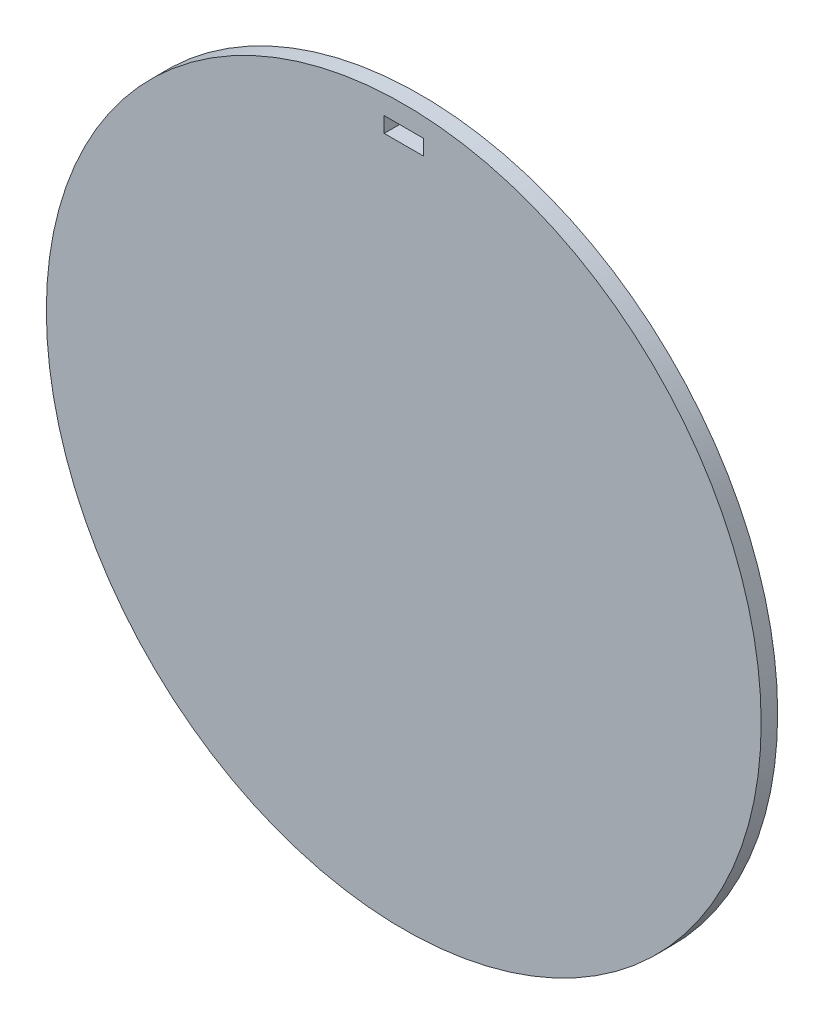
ISO-10303-21;
HEADER;
FILE_DESCRIPTION(('STEP AP214'),'2;1');
FILE_NAME('part.step','',(''),(''),'','','');
FILE_SCHEMA(('AUTOMOTIVE_DESIGN { 1 0 10303 214 1 1 1 1 }'));
ENDSEC;
DATA;
#1=APPLICATION_CONTEXT('core data for automotive mechanical design processes');
#2=APPLICATION_PROTOCOL_DEFINITION('international standard','automotive_design',2000,#1);
#3=PRODUCT_CONTEXT('',#1,'mechanical');
#4=PRODUCT('Part','Part','',(#3));
#5=PRODUCT_RELATED_PRODUCT_CATEGORY('part','',(#4));
#6=PRODUCT_DEFINITION_FORMATION('','',#4);
#7=PRODUCT_DEFINITION_CONTEXT('part definition',#1,'design');
#8=PRODUCT_DEFINITION('design','',#6,#7);
#9=PRODUCT_DEFINITION_SHAPE('','',#8);
#10=(LENGTH_UNIT() NAMED_UNIT(*) SI_UNIT(.MILLI.,.METRE.));
#11=(NAMED_UNIT(*) PLANE_ANGLE_UNIT() SI_UNIT($,.RADIAN.));
#12=(NAMED_UNIT(*) SI_UNIT($,.STERADIAN.) SOLID_ANGLE_UNIT());
#13=UNCERTAINTY_MEASURE_WITH_UNIT(LENGTH_MEASURE(1.E-05),#10,'distance_accuracy_value','');
#14=(GEOMETRIC_REPRESENTATION_CONTEXT(3) GLOBAL_UNCERTAINTY_ASSIGNED_CONTEXT((#13)) GLOBAL_UNIT_ASSIGNED_CONTEXT((#10,
#11,#12)) REPRESENTATION_CONTEXT('',''));
#15=CARTESIAN_POINT('',(0.,0.,0.));
#16=DIRECTION('',(0.,0.,1.));
#17=DIRECTION('',(1.,0.,0.));
#18=AXIS2_PLACEMENT_3D('',#15,#16,#17);
#19=CARTESIAN_POINT('',(0.,0.,3.));
#20=DIRECTION('',(0.,0.,1.));
#21=DIRECTION('',(1.,0.,0.));
#22=AXIS2_PLACEMENT_3D('',#19,#20,#21);
#23=PLANE('',#22);
#24=CARTESIAN_POINT('',(0.,0.,3.));
#25=DIRECTION('',(0.,0.,1.));
#26=DIRECTION('',(1.,0.,0.));
#27=AXIS2_PLACEMENT_3D('',#24,#25,#26);
#28=CIRCLE('',#27,65.);
#29=CARTESIAN_POINT('',(65.,0.,3.));
#30=VERTEX_POINT('',#29);
#31=EDGE_CURVE('E11',#30,#30,#28,.T.);
#32=ORIENTED_EDGE('',*,*,#31,.T.);
#33=EDGE_LOOP('',(#32));
#34=FACE_BOUND('',#33,.T.);
#35=DIRECTION('',(0.,1.,0.));
#36=VECTOR('',#35,1.);
#37=CARTESIAN_POINT('',(3.554,58.6,3.));
#38=LINE('',#37,#36);
#39=CARTESIAN_POINT('',(3.554,58.6,3.));
#40=VERTEX_POINT('',#39);
#41=CARTESIAN_POINT('',(3.554,61.4,3.));
#42=VERTEX_POINT('',#41);
#43=EDGE_CURVE('E96',#40,#42,#38,.T.);
#44=ORIENTED_EDGE('',*,*,#43,.F.);
#45=DIRECTION('',(1.,0.,0.));
#46=VECTOR('',#45,1.);
#47=CARTESIAN_POINT('',(-3.554,58.6,3.));
#48=LINE('',#47,#46);
#49=CARTESIAN_POINT('',(-3.554,58.6,3.));
#50=VERTEX_POINT('',#49);
#51=EDGE_CURVE('E87',#50,#40,#48,.T.);
#52=ORIENTED_EDGE('',*,*,#51,.F.);
#53=DIRECTION('',(0.,-1.,0.));
#54=VECTOR('',#53,1.);
#55=CARTESIAN_POINT('',(-3.554,58.6,3.));
#56=LINE('',#55,#54);
#57=CARTESIAN_POINT('',(-3.554,61.4,3.));
#58=VERTEX_POINT('',#57);
#59=EDGE_CURVE('E112',#58,#50,#56,.T.);
#60=ORIENTED_EDGE('',*,*,#59,.F.);
#61=DIRECTION('',(-1.,0.,0.));
#62=VECTOR('',#61,1.);
#63=CARTESIAN_POINT('',(-3.554,61.4,3.));
#64=LINE('',#63,#62);
#65=EDGE_CURVE('E108',#42,#58,#64,.T.);
#66=ORIENTED_EDGE('',*,*,#65,.F.);
#67=EDGE_LOOP('',(#44,#52,#60,#66));
#68=FACE_BOUND('',#67,.T.);
#69=ADVANCED_FACE('F45',(#34,#68),#23,.T.);
#70=CARTESIAN_POINT('',(0.,0.,0.));
#71=DIRECTION('',(0.,0.,1.));
#72=DIRECTION('',(1.,0.,0.));
#73=AXIS2_PLACEMENT_3D('',#70,#71,#72);
#74=PLANE('',#73);
#75=CARTESIAN_POINT('',(0.,0.,0.));
#76=DIRECTION('',(0.,0.,1.));
#77=DIRECTION('',(1.,0.,0.));
#78=AXIS2_PLACEMENT_3D('',#75,#76,#77);
#79=CIRCLE('',#78,65.);
#80=CARTESIAN_POINT('',(65.,0.,0.));
#81=VERTEX_POINT('',#80);
#82=EDGE_CURVE('E49',#81,#81,#79,.T.);
#83=ORIENTED_EDGE('',*,*,#82,.F.);
#84=EDGE_LOOP('',(#83));
#85=FACE_BOUND('',#84,.T.);
#86=DIRECTION('',(1.,0.,0.));
#87=VECTOR('',#86,1.);
#88=CARTESIAN_POINT('',(-3.554,58.6,0.));
#89=LINE('',#88,#87);
#90=CARTESIAN_POINT('',(-3.554,58.6,0.));
#91=VERTEX_POINT('',#90);
#92=CARTESIAN_POINT('',(3.554,58.6,0.));
#93=VERTEX_POINT('',#92);
#94=EDGE_CURVE('E69',#91,#93,#89,.T.);
#95=ORIENTED_EDGE('',*,*,#94,.T.);
#96=DIRECTION('',(0.,1.,0.));
#97=VECTOR('',#96,1.);
#98=CARTESIAN_POINT('',(3.554,58.6,0.));
#99=LINE('',#98,#97);
#100=CARTESIAN_POINT('',(3.554,61.4,0.));
#101=VERTEX_POINT('',#100);
#102=EDGE_CURVE('E103',#93,#101,#99,.T.);
#103=ORIENTED_EDGE('',*,*,#102,.T.);
#104=DIRECTION('',(-1.,0.,0.));
#105=VECTOR('',#104,1.);
#106=CARTESIAN_POINT('',(-3.554,61.4,0.));
#107=LINE('',#106,#105);
#108=CARTESIAN_POINT('',(-3.554,61.4,0.));
#109=VERTEX_POINT('',#108);
#110=EDGE_CURVE('E121',#101,#109,#107,.T.);
#111=ORIENTED_EDGE('',*,*,#110,.T.);
#112=DIRECTION('',(0.,-1.,0.));
#113=VECTOR('',#112,1.);
#114=CARTESIAN_POINT('',(-3.554,58.6,0.));
#115=LINE('',#114,#113);
#116=EDGE_CURVE('E97',#109,#91,#115,.T.);
#117=ORIENTED_EDGE('',*,*,#116,.T.);
#118=EDGE_LOOP('',(#95,#103,#111,#117));
#119=FACE_BOUND('',#118,.T.);
#120=ADVANCED_FACE('F137',(#85,#119),#74,.F.);
#121=CARTESIAN_POINT('',(0.,0.,3.));
#122=DIRECTION('',(0.,0.,-1.));
#123=DIRECTION('',(-1.,0.,0.));
#124=AXIS2_PLACEMENT_3D('',#121,#122,#123);
#125=CYLINDRICAL_SURFACE('',#124,65.);
#126=ORIENTED_EDGE('',*,*,#31,.F.);
#127=EDGE_LOOP('',(#126));
#128=FACE_BOUND('',#127,.T.);
#129=ORIENTED_EDGE('',*,*,#82,.T.);
#130=EDGE_LOOP('',(#129));
#131=FACE_BOUND('',#130,.T.);
#132=ADVANCED_FACE('F47',(#128,#131),#125,.T.);
#133=CARTESIAN_POINT('',(-3.554,58.6,3.));
#134=DIRECTION('',(0.,1.,0.));
#135=DIRECTION('',(0.,0.,1.));
#136=AXIS2_PLACEMENT_3D('',#133,#134,#135);
#137=PLANE('',#136);
#138=ORIENTED_EDGE('',*,*,#94,.F.);
#139=DIRECTION('',(0.,0.,-1.));
#140=VECTOR('',#139,1.);
#141=CARTESIAN_POINT('',(-3.554,58.6,3.));
#142=LINE('',#141,#140);
#143=EDGE_CURVE('E91',#50,#91,#142,.T.);
#144=ORIENTED_EDGE('',*,*,#143,.F.);
#145=ORIENTED_EDGE('',*,*,#51,.T.);
#146=DIRECTION('',(0.,0.,-1.));
#147=VECTOR('',#146,1.);
#148=CARTESIAN_POINT('',(3.554,58.6,3.));
#149=LINE('',#148,#147);
#150=EDGE_CURVE('E90',#40,#93,#149,.T.);
#151=ORIENTED_EDGE('',*,*,#150,.T.);
#152=EDGE_LOOP('',(#138,#144,#145,#151));
#153=FACE_BOUND('',#152,.T.);
#154=ADVANCED_FACE('F89',(#153),#137,.T.);
#155=CARTESIAN_POINT('',(3.554,58.6,3.));
#156=DIRECTION('',(-1.,0.,0.));
#157=DIRECTION('',(0.,0.,1.));
#158=AXIS2_PLACEMENT_3D('',#155,#156,#157);
#159=PLANE('',#158);
#160=ORIENTED_EDGE('',*,*,#102,.F.);
#161=ORIENTED_EDGE('',*,*,#150,.F.);
#162=ORIENTED_EDGE('',*,*,#43,.T.);
#163=DIRECTION('',(0.,0.,-1.));
#164=VECTOR('',#163,1.);
#165=CARTESIAN_POINT('',(3.554,61.4,3.));
#166=LINE('',#165,#164);
#167=EDGE_CURVE('E105',#42,#101,#166,.T.);
#168=ORIENTED_EDGE('',*,*,#167,.T.);
#169=EDGE_LOOP('',(#160,#161,#162,#168));
#170=FACE_BOUND('',#169,.T.);
#171=ADVANCED_FACE('F100',(#170),#159,.T.);
#172=CARTESIAN_POINT('',(-3.554,61.4,3.));
#173=DIRECTION('',(0.,-1.,0.));
#174=DIRECTION('',(0.,0.,-1.));
#175=AXIS2_PLACEMENT_3D('',#172,#173,#174);
#176=PLANE('',#175);
#177=ORIENTED_EDGE('',*,*,#110,.F.);
#178=ORIENTED_EDGE('',*,*,#167,.F.);
#179=ORIENTED_EDGE('',*,*,#65,.T.);
#180=DIRECTION('',(0.,0.,-1.));
#181=VECTOR('',#180,1.);
#182=CARTESIAN_POINT('',(-3.554,61.4,3.));
#183=LINE('',#182,#181);
#184=EDGE_CURVE('E61',#58,#109,#183,.T.);
#185=ORIENTED_EDGE('',*,*,#184,.T.);
#186=EDGE_LOOP('',(#177,#178,#179,#185));
#187=FACE_BOUND('',#186,.T.);
#188=ADVANCED_FACE('F135',(#187),#176,.T.);
#189=CARTESIAN_POINT('',(-3.554,58.6,3.));
#190=DIRECTION('',(1.,0.,0.));
#191=DIRECTION('',(0.,0.,-1.));
#192=AXIS2_PLACEMENT_3D('',#189,#190,#191);
#193=PLANE('',#192);
#194=ORIENTED_EDGE('',*,*,#116,.F.);
#195=ORIENTED_EDGE('',*,*,#184,.F.);
#196=ORIENTED_EDGE('',*,*,#59,.T.);
#197=ORIENTED_EDGE('',*,*,#143,.T.);
#198=EDGE_LOOP('',(#194,#195,#196,#197));
#199=FACE_BOUND('',#198,.T.);
#200=ADVANCED_FACE('F138',(#199),#193,.T.);
#201=CLOSED_SHELL('',(#69,#120,#132,#154,#171,#188,#200));
#202=MANIFOLD_SOLID_BREP('B2',#201);
#203=ADVANCED_BREP_SHAPE_REPRESENTATION('',(#18,#202),#14);
#204=SHAPE_DEFINITION_REPRESENTATION(#9,#203);
ENDSEC;
END-ISO-10303-21;
